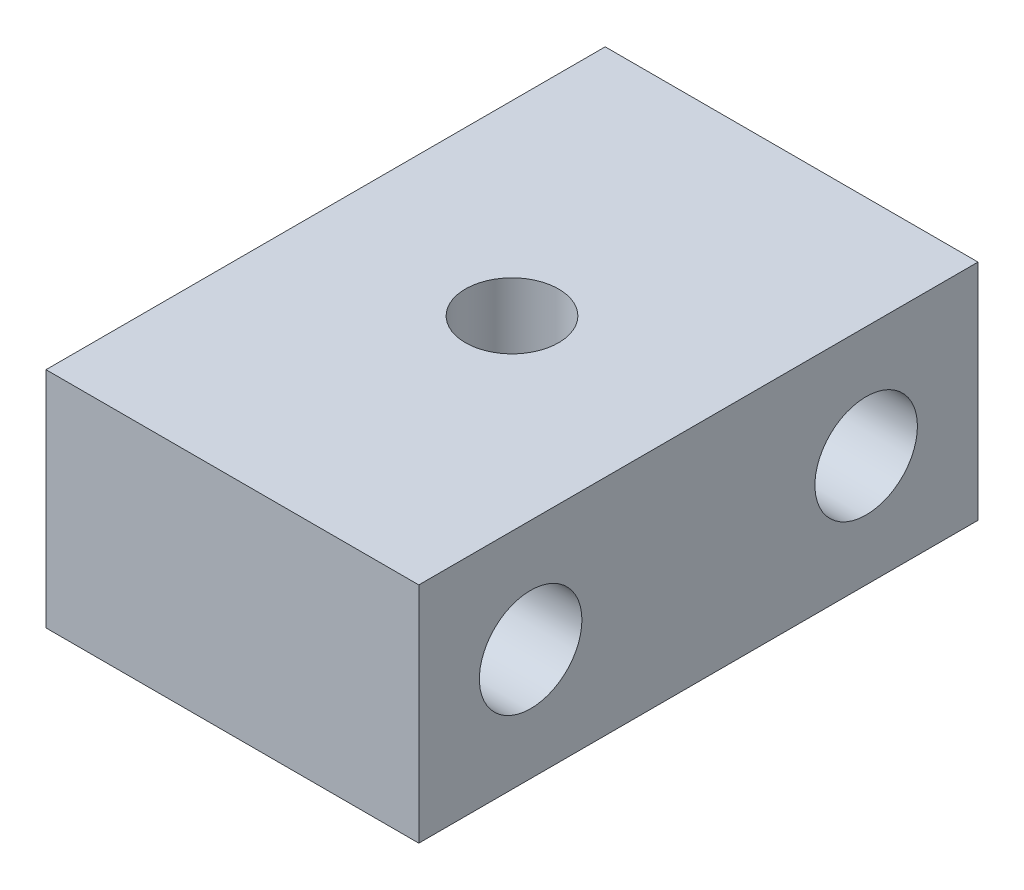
from build123d import *

# Parameters (mm, degrees)
SKETCH_1_W          = 20
SKETCH_1_H          = 12
EXTRUDE_1_DEPTH     = 30
SKETCH_2_R          = 2.75
CUT_EXTRUDE_1_DEPTH = 30
SKETCH_3_R          = 4.75
CUT_EXTRUDE_2_DEPTH = 5.5
SKETCH_4_R          = 2.5
CUT_EXTRUDE_3_DEPTH = 39


with BuildPart() as part:
    # Sketch 1 → Extrude 1 (new body)
    with BuildSketch(Plane.XY):
        with Locations((10, 6)):
            Rectangle(SKETCH_1_W, SKETCH_1_H)
    extrude(amount=EXTRUDE_1_DEPTH)

    # Sketch 2 → Cut-Extrude 1 (cut)
    with BuildSketch(Plane(origin=(20, 0, 0), x_dir=(0, 0, -1), z_dir=(1, 0, 0))):
        with Locations((-24, 6)):
            Circle(SKETCH_2_R)
        with Locations((-6, 6)):
            Circle(SKETCH_2_R)
    extrude(amount=-CUT_EXTRUDE_1_DEPTH, mode=Mode.SUBTRACT)

    # Sketch 3 → Cut-Extrude 2 (cut)
    with BuildSketch(Plane.ZY):
        with Locations((6, 6)):
            Circle(SKETCH_3_R)
        with Locations((24, 6)):
            Circle(SKETCH_3_R)
    extrude(amount=-CUT_EXTRUDE_2_DEPTH, mode=Mode.SUBTRACT)

    # Sketch 4 → Cut-Extrude 3 (cut, through all)
    with BuildSketch(Plane(origin=(0, 12, 0), x_dir=(1, 0, 0), z_dir=(0, 1, 0))):
        with Locations(Location((10, -15, 0), (0, 0, 270))):
            Circle(SKETCH_4_R)
    extrude(amount=-CUT_EXTRUDE_3_DEPTH, mode=Mode.SUBTRACT)


solid = part.part
